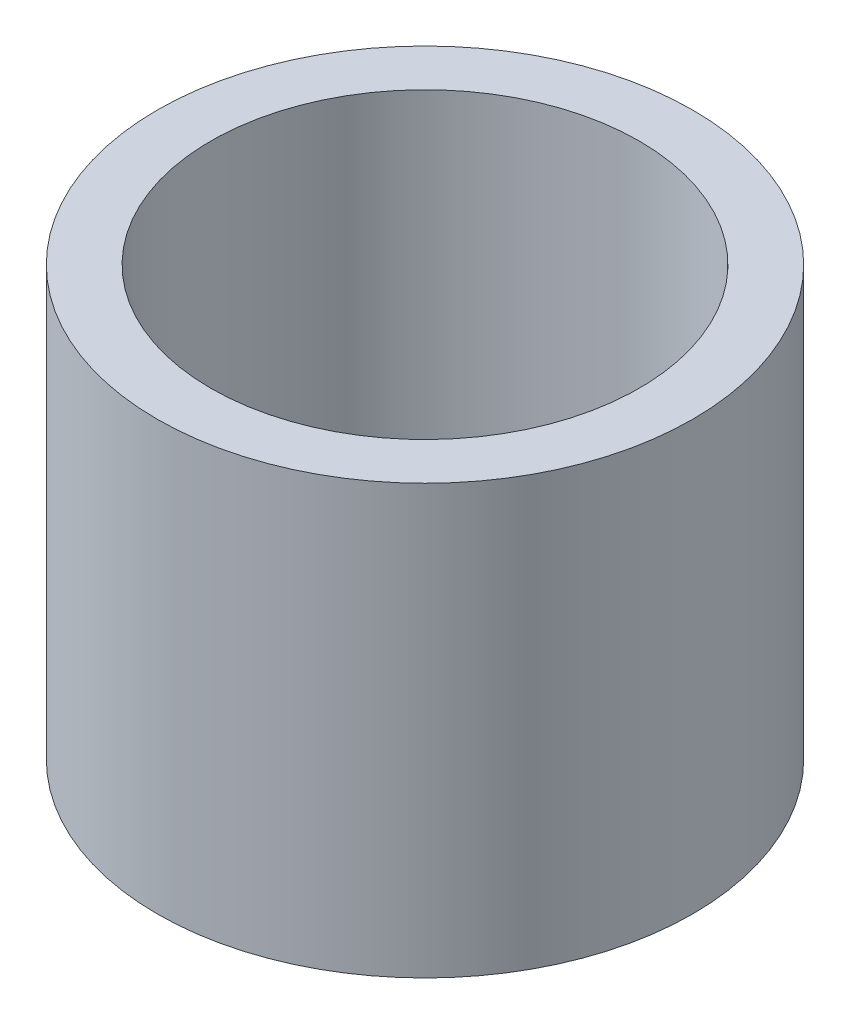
from build123d import *

# Parameters (mm, degrees)
ESQUISSE1_R      = 12.5
ESQUISSE1_R_2    = 10
EXTRUSION1_DEPTH = 20


with BuildPart() as part:
    # Esquisse1 → Extrusion1 (new body)
    with BuildSketch(Plane(origin=(0, 0, 0), x_dir=(1, 0, 0), z_dir=(0, 1, 0))):
        with Locations(Location((0, 0, 0), (0, 0, 270))):
            Circle(ESQUISSE1_R)
        with Locations(Location((0, 0, 0), (0, 0, 270))):
            Circle(ESQUISSE1_R_2, mode=Mode.SUBTRACT)
    extrude(amount=-EXTRUSION1_DEPTH)


solid = part.part
